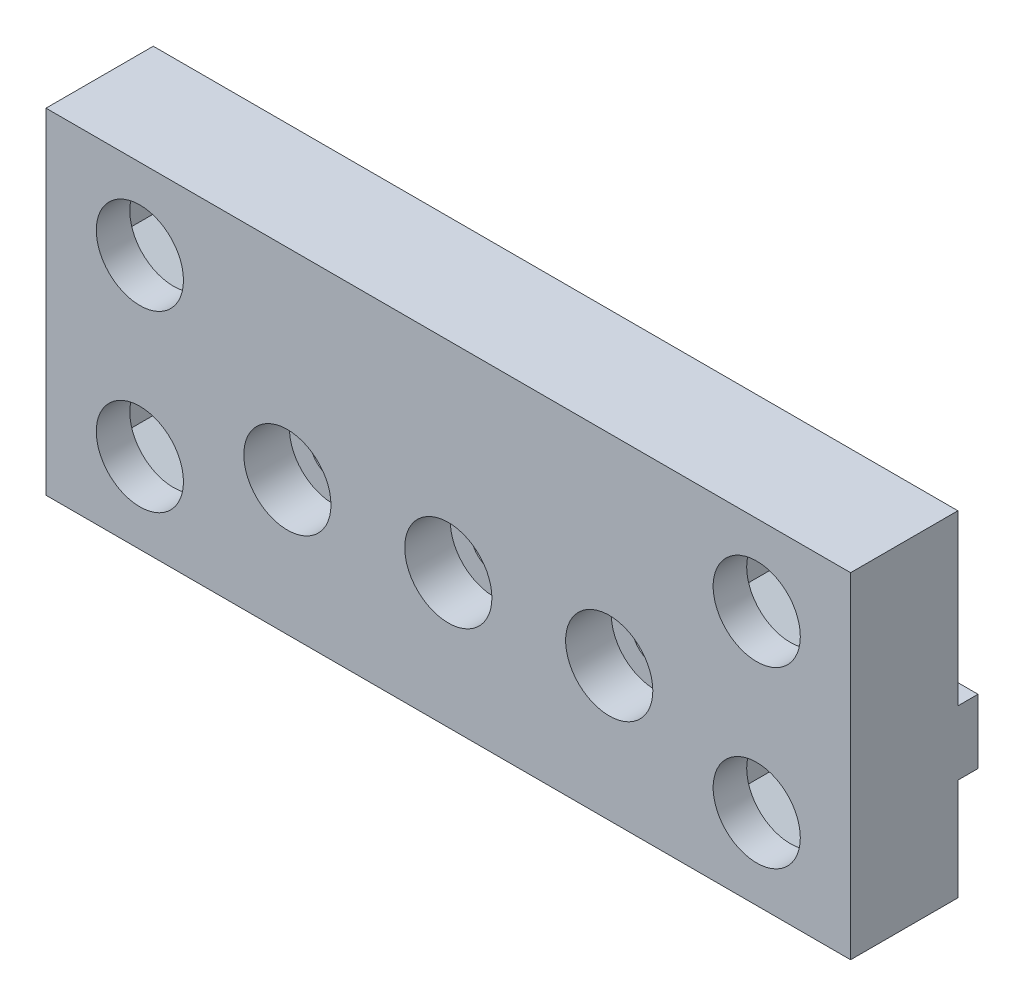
from build123d import *

# Parameters (mm, degrees)
SKIZZE1_W                                            = 60
SKIZZE1_H                                            = 25
AUFSATZ_LINEAR_AUSTRAGEN1_DEPTH                      = 4
SKIZZE4_W                                            = 60
SKIZZE4_H                                            = 4.8
AUFSATZ_LINEAR_AUSTRAGEN2_DEPTH                      = 1.5
F_6_5_6_5_DURCHMESSER_BOHRUNG1_D                     = 6.5
SCHNITT_LINEAR_AUSTRAGEN1_DEPTH                      = 34.470135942
SCHNITT_LINEAR_AUSTRAGEN1_DEPTH_BACK                 = 5.5
STIRNSENKUNG_F_R_M3_ZYLINDERSCHRAUBE_MIT_D           = 3.4
STIRNSENKUNG_F_R_M3_ZYLINDERSCHRAUBE_MIT_CBORE_D     = 6.5
STIRNSENKUNG_F_R_M3_ZYLINDERSCHRAUBE_MIT_CBORE_DEPTH = 3.4


with BuildPart() as part:
    # Skizze1 → Aufsatz-Linear austragen1 (new, symmetric)
    with BuildSketch(Plane.XY):
        Rectangle(SKIZZE1_W, SKIZZE1_H)
    extrude(amount=AUFSATZ_LINEAR_AUSTRAGEN1_DEPTH, both=True)

    # Skizze4 → Aufsatz-Linear austragen2 (add, symmetric)
    with BuildSketch(Plane(origin=(0, 0, -4), x_dir=(-1, 0, 0), z_dir=(0, 0, -1))):
        with Locations((0, -2.5)):
            Rectangle(SKIZZE4_W, SKIZZE4_H)
    extrude(amount=AUFSATZ_LINEAR_AUSTRAGEN2_DEPTH, both=True)

    # 6.5 _6.5_ Durchmesser Bohrung1 (through all)
    with Locations(Plane.XY.offset(4)):
        with Locations((-23, 6.5), (23, 6.5), (-23, -6.5), (23, -6.5)):
            Hole(F_6_5_6_5_DURCHMESSER_BOHRUNG1_D / 2)

    # Skizze5 → Schnitt-Linear austragen1 (cut, two sides: drawn at the far end of the back side and taken through both)
    with BuildSketch(Plane(origin=(0, 0, -4), x_dir=(-1, 0, 0), z_dir=(0, 0, -1)).offset(-SCHNITT_LINEAR_AUSTRAGEN1_DEPTH_BACK)):
        Polygon((-23, 12.388972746), (-28.1, 9.444486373), (-28.1, 3.555513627), (-23, 0.611027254), (-17.9, 3.555513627), (-17.9, 9.444486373), align=None)
        Polygon((23, 12.388972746), (17.9, 9.444486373), (17.9, 3.555513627), (23, 0.611027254), (28.1, 3.555513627), (28.1, 9.444486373), align=None)
        Polygon((-23, -0.611027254), (-28.1, -3.555513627), (-28.1, -9.444486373), (-23, -12.388972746), (-17.9, -9.444486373), (-17.9, -3.555513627), align=None)
        Polygon((23, -0.611027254), (17.9, -3.555513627), (17.9, -9.444486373), (23, -12.388972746), (28.1, -9.444486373), (28.1, -3.555513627), align=None)
    extrude(amount=SCHNITT_LINEAR_AUSTRAGEN1_DEPTH + SCHNITT_LINEAR_AUSTRAGEN1_DEPTH_BACK, mode=Mode.SUBTRACT)

    # Stirnsenkung f_r M3 Zylinderschraube mit (through all)
    with Locations(Plane.XY.offset(4)):
        with Locations((-12, -2.5), (0, -2.5), (12, -2.5)):
            CounterBoreHole(STIRNSENKUNG_F_R_M3_ZYLINDERSCHRAUBE_MIT_D / 2, STIRNSENKUNG_F_R_M3_ZYLINDERSCHRAUBE_MIT_CBORE_D / 2, STIRNSENKUNG_F_R_M3_ZYLINDERSCHRAUBE_MIT_CBORE_DEPTH)


solid = part.part
